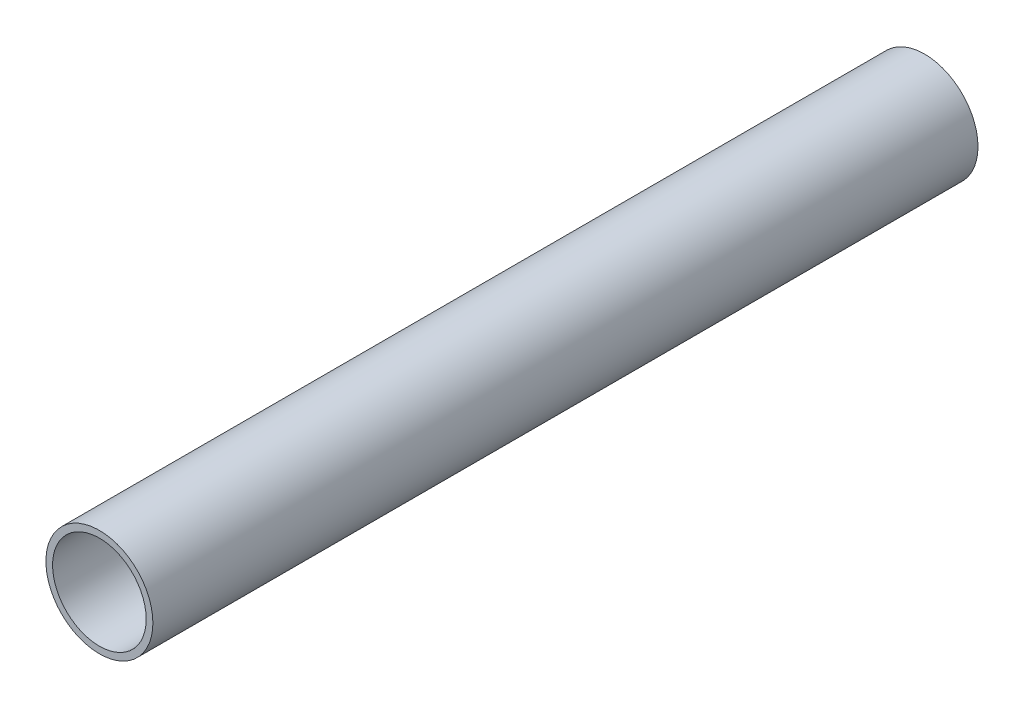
from build123d import *

# Parameters (mm, degrees)
ESQUISSE1_R        = 16
ESQUISSE1_R_2      = 14
EXTRU_MINCE1_DEPTH = 123.4


with BuildPart() as part:
    # Esquisse1 → Extru.-Mince1 (new, symmetric)
    with BuildSketch(Plane.XY):
        Circle(ESQUISSE1_R)
        Circle(ESQUISSE1_R_2, mode=Mode.SUBTRACT)
    extrude(amount=EXTRU_MINCE1_DEPTH, both=True)


solid = part.part
